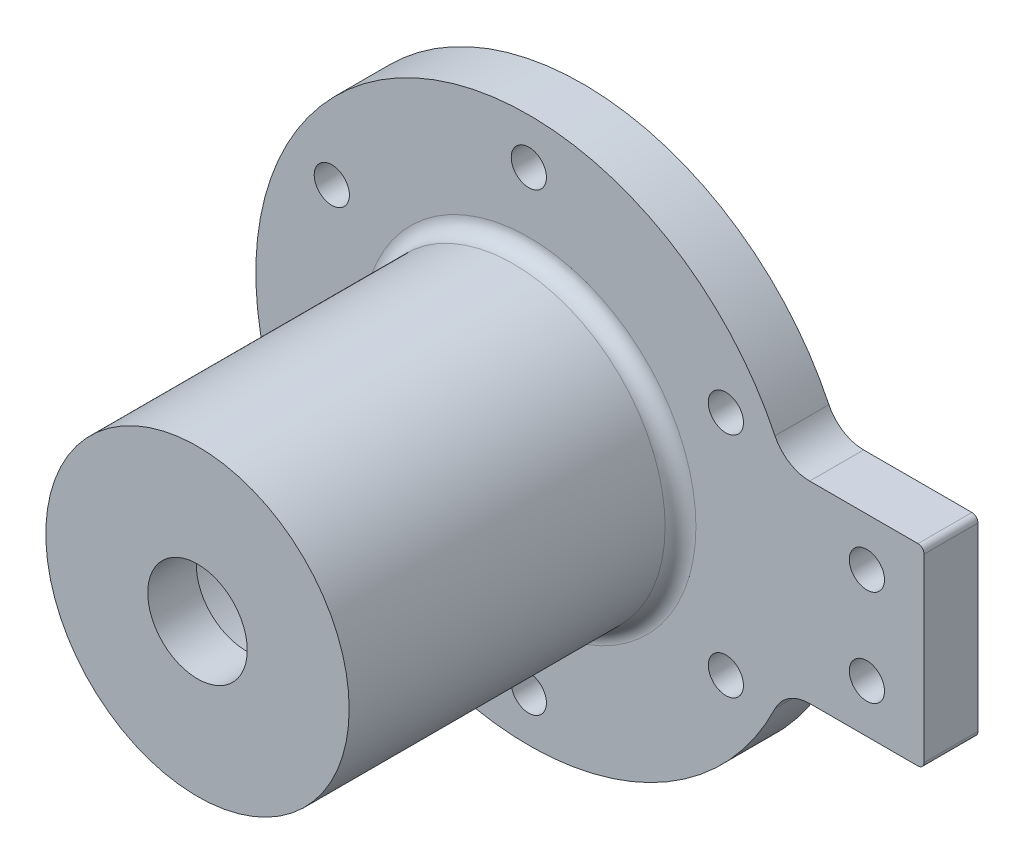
ISO-10303-21;
HEADER;
FILE_DESCRIPTION(('STEP AP214'),'2;1');
FILE_NAME('part.step','',(''),(''),'','','');
FILE_SCHEMA(('AUTOMOTIVE_DESIGN { 1 0 10303 214 1 1 1 1 }'));
ENDSEC;
DATA;
#1=APPLICATION_CONTEXT('core data for automotive mechanical design processes');
#2=APPLICATION_PROTOCOL_DEFINITION('international standard','automotive_design',2000,#1);
#3=PRODUCT_CONTEXT('',#1,'mechanical');
#4=PRODUCT('Part','Part','',(#3));
#5=PRODUCT_RELATED_PRODUCT_CATEGORY('part','',(#4));
#6=PRODUCT_DEFINITION_FORMATION('','',#4);
#7=PRODUCT_DEFINITION_CONTEXT('part definition',#1,'design');
#8=PRODUCT_DEFINITION('design','',#6,#7);
#9=PRODUCT_DEFINITION_SHAPE('','',#8);
#10=(LENGTH_UNIT() NAMED_UNIT(*) SI_UNIT(.MILLI.,.METRE.));
#11=(NAMED_UNIT(*) PLANE_ANGLE_UNIT() SI_UNIT($,.RADIAN.));
#12=(NAMED_UNIT(*) SI_UNIT($,.STERADIAN.) SOLID_ANGLE_UNIT());
#13=UNCERTAINTY_MEASURE_WITH_UNIT(LENGTH_MEASURE(1.E-05),#10,'distance_accuracy_value','');
#14=(GEOMETRIC_REPRESENTATION_CONTEXT(3) GLOBAL_UNCERTAINTY_ASSIGNED_CONTEXT((#13)) GLOBAL_UNIT_ASSIGNED_CONTEXT((#10,
#11,#12)) REPRESENTATION_CONTEXT('',''));
#15=CARTESIAN_POINT('',(0.,0.,0.));
#16=DIRECTION('',(0.,0.,1.));
#17=DIRECTION('',(1.,0.,0.));
#18=AXIS2_PLACEMENT_3D('',#15,#16,#17);
#19=CARTESIAN_POINT('',(0.,0.,0.));
#20=DIRECTION('',(0.,0.,1.));
#21=DIRECTION('',(1.,0.,0.));
#22=AXIS2_PLACEMENT_3D('',#19,#20,#21);
#23=PLANE('',#22);
#24=CARTESIAN_POINT('',(32.4759526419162,18.7500000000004,0.));
#25=DIRECTION('',(0.,0.,-1.));
#26=DIRECTION('',(-1.,0.,0.));
#27=AXIS2_PLACEMENT_3D('',#24,#25,#26);
#28=CIRCLE('',#27,2.89999999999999);
#29=CARTESIAN_POINT('',(29.5759526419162,18.7500000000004,0.));
#30=VERTEX_POINT('',#29);
#31=EDGE_CURVE('E158',#30,#30,#28,.T.);
#32=ORIENTED_EDGE('',*,*,#31,.F.);
#33=EDGE_LOOP('',(#32));
#34=FACE_BOUND('',#33,.T.);
#35=CARTESIAN_POINT('',(32.4759526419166,-18.7499999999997,0.));
#36=DIRECTION('',(0.,0.,-1.));
#37=DIRECTION('',(-1.,0.,0.));
#38=AXIS2_PLACEMENT_3D('',#35,#36,#37);
#39=CIRCLE('',#38,2.89999999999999);
#40=CARTESIAN_POINT('',(29.5759526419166,-18.7499999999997,0.));
#41=VERTEX_POINT('',#40);
#42=EDGE_CURVE('E182',#41,#41,#39,.T.);
#43=ORIENTED_EDGE('',*,*,#42,.F.);
#44=EDGE_LOOP('',(#43));
#45=FACE_BOUND('',#44,.T.);
#46=CARTESIAN_POINT('',(55.7158355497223,7.93750000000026,0.));
#47=DIRECTION('',(0.,0.,-1.));
#48=DIRECTION('',(-1.,0.,0.));
#49=AXIS2_PLACEMENT_3D('',#46,#47,#48);
#50=CIRCLE('',#49,2.89999999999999);
#51=CARTESIAN_POINT('',(52.8158355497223,7.93750000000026,0.));
#52=VERTEX_POINT('',#51);
#53=EDGE_CURVE('E186',#52,#52,#50,.T.);
#54=ORIENTED_EDGE('',*,*,#53,.F.);
#55=EDGE_LOOP('',(#54));
#56=FACE_BOUND('',#55,.T.);
#57=CARTESIAN_POINT('',(0.,0.,0.));
#58=DIRECTION('',(0.,0.,1.));
#59=DIRECTION('',(1.,0.,0.));
#60=AXIS2_PLACEMENT_3D('',#57,#58,#59);
#61=CIRCLE('',#60,20.);
#62=CARTESIAN_POINT('',(20.,0.,0.));
#63=VERTEX_POINT('',#62);
#64=EDGE_CURVE('E210',#63,#63,#61,.T.);
#65=ORIENTED_EDGE('',*,*,#64,.T.);
#66=EDGE_LOOP('',(#65));
#67=FACE_BOUND('',#66,.T.);
#68=DIRECTION('',(-1.,0.,0.));
#69=VECTOR('',#68,1.);
#70=CARTESIAN_POINT('',(0.,15.875,0.));
#71=LINE('',#70,#69);
#72=CARTESIAN_POINT('',(64.1405069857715,15.8749999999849,0.));
#73=VERTEX_POINT('',#72);
#74=CARTESIAN_POINT('',(46.2911641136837,15.875,0.));
#75=VERTEX_POINT('',#74);
#76=EDGE_CURVE('E200',#73,#75,#71,.T.);
#77=ORIENTED_EDGE('',*,*,#76,.F.);
#78=CARTESIAN_POINT('',(64.1405069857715,14.874999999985,0.));
#79=DIRECTION('',(0.,0.,1.));
#80=DIRECTION('',(1.,0.,0.));
#81=AXIS2_PLACEMENT_3D('',#78,#79,#80);
#82=CIRCLE('',#81,0.999999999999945);
#83=CARTESIAN_POINT('',(65.1405069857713,14.874999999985,0.));
#84=VERTEX_POINT('',#83);
#85=EDGE_CURVE('E129',#84,#73,#82,.T.);
#86=ORIENTED_EDGE('',*,*,#85,.F.);
#87=DIRECTION('',(0.,1.,0.));
#88=VECTOR('',#87,1.);
#89=CARTESIAN_POINT('',(65.1405069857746,-2.20433296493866E-12,0.));
#90=LINE('',#89,#88);
#91=CARTESIAN_POINT('',(65.1405069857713,-14.8750000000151,0.));
#92=VERTEX_POINT('',#91);
#93=EDGE_CURVE('E194',#92,#84,#90,.T.);
#94=ORIENTED_EDGE('',*,*,#93,.F.);
#95=CARTESIAN_POINT('',(64.1405069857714,-14.8750000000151,0.));
#96=DIRECTION('',(0.,0.,1.));
#97=DIRECTION('',(1.,0.,0.));
#98=AXIS2_PLACEMENT_3D('',#95,#96,#97);
#99=CIRCLE('',#98,0.999999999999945);
#100=CARTESIAN_POINT('',(64.1405069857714,-15.875000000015,0.));
#101=VERTEX_POINT('',#100);
#102=EDGE_CURVE('E140',#101,#92,#99,.T.);
#103=ORIENTED_EDGE('',*,*,#102,.F.);
#104=DIRECTION('',(-1.,0.,0.));
#105=VECTOR('',#104,1.);
#106=CARTESIAN_POINT('',(0.,-15.875,0.));
#107=LINE('',#106,#105);
#108=CARTESIAN_POINT('',(46.2911641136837,-15.875,0.));
#109=VERTEX_POINT('',#108);
#110=EDGE_CURVE('E121',#101,#109,#107,.T.);
#111=ORIENTED_EDGE('',*,*,#110,.T.);
#112=CARTESIAN_POINT('',(46.2911641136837,-22.225,0.));
#113=DIRECTION('',(0.,0.,1.));
#114=DIRECTION('',(1.,0.,0.));
#115=AXIS2_PLACEMENT_3D('',#112,#113,#114);
#116=CIRCLE('',#115,6.35);
#117=CARTESIAN_POINT('',(40.5667455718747,-19.4766309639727,0.));
#118=VERTEX_POINT('',#117);
#119=EDGE_CURVE('E66',#109,#118,#116,.T.);
#120=ORIENTED_EDGE('',*,*,#119,.T.);
#121=CARTESIAN_POINT('',(0.,0.,0.));
#122=DIRECTION('',(0.,0.,1.));
#123=DIRECTION('',(1.,0.,0.));
#124=AXIS2_PLACEMENT_3D('',#121,#122,#123);
#125=CIRCLE('',#124,45.);
#126=CARTESIAN_POINT('',(40.5667455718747,19.4766309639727,0.));
#127=VERTEX_POINT('',#126);
#128=EDGE_CURVE('E120',#127,#118,#125,.T.);
#129=ORIENTED_EDGE('',*,*,#128,.F.);
#130=CARTESIAN_POINT('',(46.2911641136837,22.225,0.));
#131=DIRECTION('',(0.,0.,1.));
#132=DIRECTION('',(1.,0.,0.));
#133=AXIS2_PLACEMENT_3D('',#130,#131,#132);
#134=CIRCLE('',#133,6.35);
#135=EDGE_CURVE('E224',#127,#75,#134,.T.);
#136=ORIENTED_EDGE('',*,*,#135,.T.);
#137=EDGE_LOOP('',(#77,#86,#94,#103,#111,#120,#129,#136));
#138=FACE_BOUND('',#137,.T.);
#139=CARTESIAN_POINT('',(55.7158355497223,-7.93749999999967,0.));
#140=DIRECTION('',(0.,0.,-1.));
#141=DIRECTION('',(-1.,0.,0.));
#142=AXIS2_PLACEMENT_3D('',#139,#140,#141);
#143=CIRCLE('',#142,2.89999999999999);
#144=CARTESIAN_POINT('',(52.8158355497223,-7.93749999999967,0.));
#145=VERTEX_POINT('',#144);
#146=EDGE_CURVE('E190',#145,#145,#143,.T.);
#147=ORIENTED_EDGE('',*,*,#146,.F.);
#148=EDGE_LOOP('',(#147));
#149=FACE_BOUND('',#148,.T.);
#150=CARTESIAN_POINT('',(0.,-37.5,0.));
#151=DIRECTION('',(0.,0.,-1.));
#152=DIRECTION('',(-1.,0.,0.));
#153=AXIS2_PLACEMENT_3D('',#150,#151,#152);
#154=CIRCLE('',#153,2.89999999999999);
#155=CARTESIAN_POINT('',(-2.89999999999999,-37.5,0.));
#156=VERTEX_POINT('',#155);
#157=EDGE_CURVE('E178',#156,#156,#154,.T.);
#158=ORIENTED_EDGE('',*,*,#157,.F.);
#159=EDGE_LOOP('',(#158));
#160=FACE_BOUND('',#159,.T.);
#161=CARTESIAN_POINT('',(-32.4759526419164,-18.7500000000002,0.));
#162=DIRECTION('',(0.,0.,-1.));
#163=DIRECTION('',(-1.,0.,0.));
#164=AXIS2_PLACEMENT_3D('',#161,#162,#163);
#165=CIRCLE('',#164,2.89999999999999);
#166=CARTESIAN_POINT('',(-35.3759526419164,-18.7500000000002,0.));
#167=VERTEX_POINT('',#166);
#168=EDGE_CURVE('E172',#167,#167,#165,.T.);
#169=ORIENTED_EDGE('',*,*,#168,.F.);
#170=EDGE_LOOP('',(#169));
#171=FACE_BOUND('',#170,.T.);
#172=CARTESIAN_POINT('',(-32.4759526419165,18.7499999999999,0.));
#173=DIRECTION('',(0.,0.,-1.));
#174=DIRECTION('',(-1.,0.,0.));
#175=AXIS2_PLACEMENT_3D('',#172,#173,#174);
#176=CIRCLE('',#175,2.89999999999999);
#177=CARTESIAN_POINT('',(-35.3759526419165,18.7499999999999,0.));
#178=VERTEX_POINT('',#177);
#179=EDGE_CURVE('E166',#178,#178,#176,.T.);
#180=ORIENTED_EDGE('',*,*,#179,.F.);
#181=EDGE_LOOP('',(#180));
#182=FACE_BOUND('',#181,.T.);
#183=CARTESIAN_POINT('',(0.,37.5,0.));
#184=DIRECTION('',(0.,0.,-1.));
#185=DIRECTION('',(-1.,0.,0.));
#186=AXIS2_PLACEMENT_3D('',#183,#184,#185);
#187=CIRCLE('',#186,2.89999999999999);
#188=CARTESIAN_POINT('',(-2.89999999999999,37.5,0.));
#189=VERTEX_POINT('',#188);
#190=EDGE_CURVE('E162',#189,#189,#187,.T.);
#191=ORIENTED_EDGE('',*,*,#190,.F.);
#192=EDGE_LOOP('',(#191));
#193=FACE_BOUND('',#192,.T.);
#194=ADVANCED_FACE('F43',(#34,#45,#56,#67,#138,#149,#160,#171,#182,#193),#23,.F.);
#195=CARTESIAN_POINT('',(0.,0.,63.5));
#196=DIRECTION('',(0.,0.,-1.));
#197=DIRECTION('',(-1.,0.,0.));
#198=AXIS2_PLACEMENT_3D('',#195,#196,#197);
#199=CYLINDRICAL_SURFACE('',#198,20.);
#200=ORIENTED_EDGE('',*,*,#64,.F.);
#201=EDGE_LOOP('',(#200));
#202=FACE_BOUND('',#201,.T.);
#203=CARTESIAN_POINT('',(0.,0.,55.5));
#204=DIRECTION('',(0.,0.,1.));
#205=DIRECTION('',(1.,0.,0.));
#206=AXIS2_PLACEMENT_3D('',#203,#204,#205);
#207=CIRCLE('',#206,20.);
#208=CARTESIAN_POINT('',(20.,0.,55.5));
#209=VERTEX_POINT('',#208);
#210=EDGE_CURVE('E205',#209,#209,#207,.T.);
#211=ORIENTED_EDGE('',*,*,#210,.T.);
#212=EDGE_LOOP('',(#211));
#213=FACE_BOUND('',#212,.T.);
#214=ADVANCED_FACE('F265',(#202,#213),#199,.F.);
#215=CARTESIAN_POINT('',(0.,0.,63.5));
#216=DIRECTION('',(0.,0.,1.));
#217=DIRECTION('',(1.,0.,0.));
#218=AXIS2_PLACEMENT_3D('',#215,#216,#217);
#219=PLANE('',#218);
#220=CARTESIAN_POINT('',(0.,0.,63.5));
#221=DIRECTION('',(0.,0.,1.));
#222=DIRECTION('',(1.,0.,0.));
#223=AXIS2_PLACEMENT_3D('',#220,#221,#222);
#224=CIRCLE('',#223,8.2);
#225=CARTESIAN_POINT('',(8.2,0.,63.5));
#226=VERTEX_POINT('',#225);
#227=EDGE_CURVE('E143',#226,#226,#224,.T.);
#228=ORIENTED_EDGE('',*,*,#227,.F.);
#229=EDGE_LOOP('',(#228));
#230=FACE_BOUND('',#229,.T.);
#231=CARTESIAN_POINT('',(0.,0.,63.5));
#232=DIRECTION('',(0.,0.,1.));
#233=DIRECTION('',(1.,0.,0.));
#234=AXIS2_PLACEMENT_3D('',#231,#232,#233);
#235=CIRCLE('',#234,25.);
#236=CARTESIAN_POINT('',(25.,0.,63.5));
#237=VERTEX_POINT('',#236);
#238=EDGE_CURVE('E213',#237,#237,#235,.T.);
#239=ORIENTED_EDGE('',*,*,#238,.T.);
#240=EDGE_LOOP('',(#239));
#241=FACE_BOUND('',#240,.T.);
#242=ADVANCED_FACE('F272',(#230,#241),#219,.T.);
#243=CARTESIAN_POINT('',(0.,0.,63.5));
#244=DIRECTION('',(0.,0.,-1.));
#245=DIRECTION('',(-1.,0.,0.));
#246=AXIS2_PLACEMENT_3D('',#243,#244,#245);
#247=CYLINDRICAL_SURFACE('',#246,25.);
#248=CARTESIAN_POINT('',(0.,0.,11.43));
#249=DIRECTION('',(0.,0.,1.));
#250=DIRECTION('',(1.,0.,0.));
#251=AXIS2_PLACEMENT_3D('',#248,#249,#250);
#252=CIRCLE('',#251,25.);
#253=CARTESIAN_POINT('',(25.,0.,11.43));
#254=VERTEX_POINT('',#253);
#255=EDGE_CURVE('E51',#254,#254,#252,.T.);
#256=ORIENTED_EDGE('',*,*,#255,.T.);
#257=EDGE_LOOP('',(#256));
#258=FACE_BOUND('',#257,.T.);
#259=ORIENTED_EDGE('',*,*,#238,.F.);
#260=EDGE_LOOP('',(#259));
#261=FACE_BOUND('',#260,.T.);
#262=ADVANCED_FACE('F244',(#258,#261),#247,.T.);
#263=CARTESIAN_POINT('',(0.,0.,55.5));
#264=DIRECTION('',(0.,0.,1.));
#265=DIRECTION('',(1.,0.,0.));
#266=AXIS2_PLACEMENT_3D('',#263,#264,#265);
#267=PLANE('',#266);
#268=CARTESIAN_POINT('',(0.,0.,55.5));
#269=DIRECTION('',(0.,0.,1.));
#270=DIRECTION('',(1.,0.,0.));
#271=AXIS2_PLACEMENT_3D('',#268,#269,#270);
#272=CIRCLE('',#271,8.2);
#273=CARTESIAN_POINT('',(8.2,0.,55.5));
#274=VERTEX_POINT('',#273);
#275=EDGE_CURVE('E155',#274,#274,#272,.F.);
#276=ORIENTED_EDGE('',*,*,#275,.F.);
#277=EDGE_LOOP('',(#276));
#278=FACE_BOUND('',#277,.T.);
#279=ORIENTED_EDGE('',*,*,#210,.F.);
#280=EDGE_LOOP('',(#279));
#281=FACE_BOUND('',#280,.T.);
#282=ADVANCED_FACE('F280',(#278,#281),#267,.F.);
#283=CARTESIAN_POINT('',(0.,0.,8.89));
#284=DIRECTION('',(0.,0.,1.));
#285=DIRECTION('',(1.,0.,0.));
#286=AXIS2_PLACEMENT_3D('',#283,#284,#285);
#287=PLANE('',#286);
#288=CARTESIAN_POINT('',(0.,0.,8.89));
#289=DIRECTION('',(0.,0.,1.));
#290=DIRECTION('',(1.,0.,0.));
#291=AXIS2_PLACEMENT_3D('',#288,#289,#290);
#292=CIRCLE('',#291,27.54);
#293=CARTESIAN_POINT('',(27.54,0.,8.89));
#294=VERTEX_POINT('',#293);
#295=EDGE_CURVE('E11',#294,#294,#292,.F.);
#296=ORIENTED_EDGE('',*,*,#295,.T.);
#297=EDGE_LOOP('',(#296));
#298=FACE_BOUND('',#297,.T.);
#299=CARTESIAN_POINT('',(32.4759526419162,18.7500000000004,8.89));
#300=DIRECTION('',(0.,0.,1.));
#301=DIRECTION('',(1.,0.,0.));
#302=AXIS2_PLACEMENT_3D('',#299,#300,#301);
#303=CIRCLE('',#302,2.89999999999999);
#304=CARTESIAN_POINT('',(35.3759526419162,18.7500000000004,8.89));
#305=VERTEX_POINT('',#304);
#306=EDGE_CURVE('E161',#305,#305,#303,.T.);
#307=ORIENTED_EDGE('',*,*,#306,.F.);
#308=EDGE_LOOP('',(#307));
#309=FACE_BOUND('',#308,.T.);
#310=CARTESIAN_POINT('',(0.,37.5,8.89));
#311=DIRECTION('',(0.,0.,1.));
#312=DIRECTION('',(1.,0.,0.));
#313=AXIS2_PLACEMENT_3D('',#310,#311,#312);
#314=CIRCLE('',#313,2.89999999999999);
#315=CARTESIAN_POINT('',(2.89999999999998,37.5,8.89));
#316=VERTEX_POINT('',#315);
#317=EDGE_CURVE('E165',#316,#316,#314,.T.);
#318=ORIENTED_EDGE('',*,*,#317,.F.);
#319=EDGE_LOOP('',(#318));
#320=FACE_BOUND('',#319,.T.);
#321=CARTESIAN_POINT('',(-32.4759526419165,18.7499999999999,8.89));
#322=DIRECTION('',(0.,0.,1.));
#323=DIRECTION('',(1.,0.,0.));
#324=AXIS2_PLACEMENT_3D('',#321,#322,#323);
#325=CIRCLE('',#324,2.89999999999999);
#326=CARTESIAN_POINT('',(-29.5759526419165,18.7499999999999,8.89));
#327=VERTEX_POINT('',#326);
#328=EDGE_CURVE('E169',#327,#327,#325,.T.);
#329=ORIENTED_EDGE('',*,*,#328,.F.);
#330=EDGE_LOOP('',(#329));
#331=FACE_BOUND('',#330,.T.);
#332=CARTESIAN_POINT('',(-32.4759526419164,-18.7500000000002,8.89));
#333=DIRECTION('',(0.,0.,1.));
#334=DIRECTION('',(1.,0.,0.));
#335=AXIS2_PLACEMENT_3D('',#332,#333,#334);
#336=CIRCLE('',#335,2.89999999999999);
#337=CARTESIAN_POINT('',(-29.5759526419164,-18.7500000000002,8.89));
#338=VERTEX_POINT('',#337);
#339=EDGE_CURVE('E175',#338,#338,#336,.T.);
#340=ORIENTED_EDGE('',*,*,#339,.F.);
#341=EDGE_LOOP('',(#340));
#342=FACE_BOUND('',#341,.T.);
#343=CARTESIAN_POINT('',(0.,-37.5,8.89));
#344=DIRECTION('',(0.,0.,1.));
#345=DIRECTION('',(1.,0.,0.));
#346=AXIS2_PLACEMENT_3D('',#343,#344,#345);
#347=CIRCLE('',#346,2.89999999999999);
#348=CARTESIAN_POINT('',(2.89999999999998,-37.5,8.89));
#349=VERTEX_POINT('',#348);
#350=EDGE_CURVE('E181',#349,#349,#347,.T.);
#351=ORIENTED_EDGE('',*,*,#350,.F.);
#352=EDGE_LOOP('',(#351));
#353=FACE_BOUND('',#352,.T.);
#354=CARTESIAN_POINT('',(32.4759526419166,-18.7499999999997,8.89));
#355=DIRECTION('',(0.,0.,1.));
#356=DIRECTION('',(1.,0.,0.));
#357=AXIS2_PLACEMENT_3D('',#354,#355,#356);
#358=CIRCLE('',#357,2.89999999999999);
#359=CARTESIAN_POINT('',(35.3759526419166,-18.7499999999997,8.89));
#360=VERTEX_POINT('',#359);
#361=EDGE_CURVE('E185',#360,#360,#358,.T.);
#362=ORIENTED_EDGE('',*,*,#361,.F.);
#363=EDGE_LOOP('',(#362));
#364=FACE_BOUND('',#363,.T.);
#365=CARTESIAN_POINT('',(55.7158355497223,7.93750000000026,8.89));
#366=DIRECTION('',(0.,0.,1.));
#367=DIRECTION('',(1.,0.,0.));
#368=AXIS2_PLACEMENT_3D('',#365,#366,#367);
#369=CIRCLE('',#368,2.89999999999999);
#370=CARTESIAN_POINT('',(58.6158355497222,7.93750000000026,8.89));
#371=VERTEX_POINT('',#370);
#372=EDGE_CURVE('E189',#371,#371,#369,.T.);
#373=ORIENTED_EDGE('',*,*,#372,.F.);
#374=EDGE_LOOP('',(#373));
#375=FACE_BOUND('',#374,.T.);
#376=CARTESIAN_POINT('',(55.7158355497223,-7.93749999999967,8.89));
#377=DIRECTION('',(0.,0.,1.));
#378=DIRECTION('',(1.,0.,0.));
#379=AXIS2_PLACEMENT_3D('',#376,#377,#378);
#380=CIRCLE('',#379,2.89999999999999);
#381=CARTESIAN_POINT('',(58.6158355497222,-7.93749999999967,8.89));
#382=VERTEX_POINT('',#381);
#383=EDGE_CURVE('E193',#382,#382,#380,.T.);
#384=ORIENTED_EDGE('',*,*,#383,.F.);
#385=EDGE_LOOP('',(#384));
#386=FACE_BOUND('',#385,.T.);
#387=DIRECTION('',(0.,-1.,0.));
#388=VECTOR('',#387,1.);
#389=CARTESIAN_POINT('',(65.1405069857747,-2.20433296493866E-12,8.89000000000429));
#390=LINE('',#389,#388);
#391=CARTESIAN_POINT('',(65.1405069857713,14.874999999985,8.88999999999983));
#392=VERTEX_POINT('',#391);
#393=CARTESIAN_POINT('',(65.1405069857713,-14.8750000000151,8.88999999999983));
#394=VERTEX_POINT('',#393);
#395=EDGE_CURVE('E134',#392,#394,#390,.T.);
#396=ORIENTED_EDGE('',*,*,#395,.F.);
#397=CARTESIAN_POINT('',(64.1405069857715,14.874999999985,8.88999999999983));
#398=DIRECTION('',(0.,0.,-1.));
#399=DIRECTION('',(-1.,0.,0.));
#400=AXIS2_PLACEMENT_3D('',#397,#398,#399);
#401=CIRCLE('',#400,0.999999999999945);
#402=CARTESIAN_POINT('',(64.1405069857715,15.874999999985,8.88999999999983));
#403=VERTEX_POINT('',#402);
#404=EDGE_CURVE('E127',#403,#392,#401,.T.);
#405=ORIENTED_EDGE('',*,*,#404,.F.);
#406=DIRECTION('',(-1.,0.,0.));
#407=VECTOR('',#406,1.);
#408=CARTESIAN_POINT('',(0.,15.875,8.89));
#409=LINE('',#408,#407);
#410=CARTESIAN_POINT('',(46.2911641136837,15.875,8.89));
#411=VERTEX_POINT('',#410);
#412=EDGE_CURVE('E110',#403,#411,#409,.T.);
#413=ORIENTED_EDGE('',*,*,#412,.T.);
#414=CARTESIAN_POINT('',(46.2911641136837,22.225,8.89));
#415=DIRECTION('',(0.,0.,1.));
#416=DIRECTION('',(1.,0.,0.));
#417=AXIS2_PLACEMENT_3D('',#414,#415,#416);
#418=CIRCLE('',#417,6.35);
#419=CARTESIAN_POINT('',(40.5667455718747,19.4766309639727,8.89));
#420=VERTEX_POINT('',#419);
#421=EDGE_CURVE('E226',#411,#420,#418,.F.);
#422=ORIENTED_EDGE('',*,*,#421,.T.);
#423=CARTESIAN_POINT('',(0.,0.,8.89));
#424=DIRECTION('',(0.,0.,1.));
#425=DIRECTION('',(1.,0.,0.));
#426=AXIS2_PLACEMENT_3D('',#423,#424,#425);
#427=CIRCLE('',#426,45.);
#428=CARTESIAN_POINT('',(40.5667455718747,-19.4766309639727,8.89));
#429=VERTEX_POINT('',#428);
#430=EDGE_CURVE('E203',#420,#429,#427,.T.);
#431=ORIENTED_EDGE('',*,*,#430,.T.);
#432=CARTESIAN_POINT('',(46.2911641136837,-22.225,8.89));
#433=DIRECTION('',(0.,0.,1.));
#434=DIRECTION('',(1.,0.,0.));
#435=AXIS2_PLACEMENT_3D('',#432,#433,#434);
#436=CIRCLE('',#435,6.35);
#437=CARTESIAN_POINT('',(46.2911641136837,-15.875,8.89));
#438=VERTEX_POINT('',#437);
#439=EDGE_CURVE('E58',#429,#438,#436,.F.);
#440=ORIENTED_EDGE('',*,*,#439,.T.);
#441=DIRECTION('',(-1.,0.,0.));
#442=VECTOR('',#441,1.);
#443=CARTESIAN_POINT('',(0.,-15.875,8.89));
#444=LINE('',#443,#442);
#445=CARTESIAN_POINT('',(64.1405069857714,-15.875000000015,8.88999999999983));
#446=VERTEX_POINT('',#445);
#447=EDGE_CURVE('E196',#446,#438,#444,.T.);
#448=ORIENTED_EDGE('',*,*,#447,.F.);
#449=CARTESIAN_POINT('',(64.1405069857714,-14.8750000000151,8.88999999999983));
#450=DIRECTION('',(0.,0.,-1.));
#451=DIRECTION('',(-1.,0.,0.));
#452=AXIS2_PLACEMENT_3D('',#449,#450,#451);
#453=CIRCLE('',#452,0.999999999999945);
#454=EDGE_CURVE('E145',#394,#446,#453,.T.);
#455=ORIENTED_EDGE('',*,*,#454,.F.);
#456=EDGE_LOOP('',(#396,#405,#413,#422,#431,#440,#448,#455));
#457=FACE_BOUND('',#456,.T.);
#458=ADVANCED_FACE('F132',(#298,#309,#320,#331,#342,#353,#364,#375,#386,#457),#287,.T.);
#459=CARTESIAN_POINT('',(0.,0.,8.89));
#460=DIRECTION('',(0.,0.,-1.));
#461=DIRECTION('',(-1.,0.,0.));
#462=AXIS2_PLACEMENT_3D('',#459,#460,#461);
#463=CYLINDRICAL_SURFACE('',#462,45.);
#464=ORIENTED_EDGE('',*,*,#430,.F.);
#465=DIRECTION('',(0.,0.,-1.));
#466=VECTOR('',#465,1.);
#467=CARTESIAN_POINT('',(40.5667455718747,19.4766309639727,8.89));
#468=LINE('',#467,#466);
#469=EDGE_CURVE('E218',#420,#127,#468,.T.);
#470=ORIENTED_EDGE('',*,*,#469,.T.);
#471=ORIENTED_EDGE('',*,*,#128,.T.);
#472=DIRECTION('',(0.,0.,-1.));
#473=VECTOR('',#472,1.);
#474=CARTESIAN_POINT('',(40.5667455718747,-19.4766309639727,8.89));
#475=LINE('',#474,#473);
#476=EDGE_CURVE('E216',#118,#429,#475,.F.);
#477=ORIENTED_EDGE('',*,*,#476,.T.);
#478=EDGE_LOOP('',(#464,#470,#471,#477));
#479=FACE_BOUND('',#478,.T.);
#480=ADVANCED_FACE('F306',(#479),#463,.T.);
#481=CARTESIAN_POINT('',(0.,-15.875,46.0994860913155));
#482=DIRECTION('',(0.,-1.,0.));
#483=DIRECTION('',(0.,0.,-1.));
#484=AXIS2_PLACEMENT_3D('',#481,#482,#483);
#485=PLANE('',#484);
#486=ORIENTED_EDGE('',*,*,#110,.F.);
#487=DIRECTION('',(0.,0.,1.));
#488=VECTOR('',#487,1.);
#489=CARTESIAN_POINT('',(64.1405069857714,-15.875000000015,-3.59210244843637));
#490=LINE('',#489,#488);
#491=EDGE_CURVE('E148',#101,#446,#490,.T.);
#492=ORIENTED_EDGE('',*,*,#491,.T.);
#493=ORIENTED_EDGE('',*,*,#447,.T.);
#494=DIRECTION('',(0.,0.,-1.));
#495=VECTOR('',#494,1.);
#496=CARTESIAN_POINT('',(46.2911641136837,-15.875,46.0994860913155));
#497=LINE('',#496,#495);
#498=EDGE_CURVE('E222',#438,#109,#497,.T.);
#499=ORIENTED_EDGE('',*,*,#498,.T.);
#500=EDGE_LOOP('',(#486,#492,#493,#499));
#501=FACE_BOUND('',#500,.T.);
#502=ADVANCED_FACE('F295',(#501),#485,.T.);
#503=CARTESIAN_POINT('',(0.,15.875,46.0994860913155));
#504=DIRECTION('',(0.,-1.,0.));
#505=DIRECTION('',(0.,0.,-1.));
#506=AXIS2_PLACEMENT_3D('',#503,#504,#505);
#507=PLANE('',#506);
#508=ORIENTED_EDGE('',*,*,#76,.T.);
#509=DIRECTION('',(0.,0.,1.));
#510=VECTOR('',#509,1.);
#511=CARTESIAN_POINT('',(46.2911641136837,15.875,8.89));
#512=LINE('',#511,#510);
#513=EDGE_CURVE('E117',#75,#411,#512,.T.);
#514=ORIENTED_EDGE('',*,*,#513,.T.);
#515=ORIENTED_EDGE('',*,*,#412,.F.);
#516=DIRECTION('',(0.,0.,1.));
#517=VECTOR('',#516,1.);
#518=CARTESIAN_POINT('',(64.1405069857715,15.874999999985,-3.59210244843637));
#519=LINE('',#518,#517);
#520=EDGE_CURVE('E114',#73,#403,#519,.T.);
#521=ORIENTED_EDGE('',*,*,#520,.F.);
#522=EDGE_LOOP('',(#508,#514,#515,#521));
#523=FACE_BOUND('',#522,.T.);
#524=ADVANCED_FACE('F113',(#523),#507,.F.);
#525=CARTESIAN_POINT('',(46.2911641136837,22.225,8.89));
#526=DIRECTION('',(0.,0.,-1.));
#527=DIRECTION('',(-1.,0.,0.));
#528=AXIS2_PLACEMENT_3D('',#525,#526,#527);
#529=CYLINDRICAL_SURFACE('',#528,6.35);
#530=ORIENTED_EDGE('',*,*,#421,.F.);
#531=ORIENTED_EDGE('',*,*,#513,.F.);
#532=ORIENTED_EDGE('',*,*,#135,.F.);
#533=ORIENTED_EDGE('',*,*,#469,.F.);
#534=EDGE_LOOP('',(#530,#531,#532,#533));
#535=FACE_BOUND('',#534,.T.);
#536=ADVANCED_FACE('F281',(#535),#529,.F.);
#537=CARTESIAN_POINT('',(46.2911641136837,-22.225,8.89));
#538=DIRECTION('',(0.,0.,-1.));
#539=DIRECTION('',(-1.,0.,0.));
#540=AXIS2_PLACEMENT_3D('',#537,#538,#539);
#541=CYLINDRICAL_SURFACE('',#540,6.35);
#542=ORIENTED_EDGE('',*,*,#439,.F.);
#543=ORIENTED_EDGE('',*,*,#476,.F.);
#544=ORIENTED_EDGE('',*,*,#119,.F.);
#545=ORIENTED_EDGE('',*,*,#498,.F.);
#546=EDGE_LOOP('',(#542,#543,#544,#545));
#547=FACE_BOUND('',#546,.T.);
#548=ADVANCED_FACE('F283',(#547),#541,.F.);
#549=CARTESIAN_POINT('',(65.1405069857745,-2.20433296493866E-12,-33.2817220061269));
#550=DIRECTION('',(-1.,0.,0.));
#551=DIRECTION('',(0.,-1.,0.));
#552=AXIS2_PLACEMENT_3D('',#549,#550,#551);
#553=PLANE('',#552);
#554=ORIENTED_EDGE('',*,*,#395,.T.);
#555=DIRECTION('',(0.,0.,1.));
#556=VECTOR('',#555,1.);
#557=CARTESIAN_POINT('',(65.1405069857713,-14.8750000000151,-3.59210244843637));
#558=LINE('',#557,#556);
#559=EDGE_CURVE('E144',#92,#394,#558,.T.);
#560=ORIENTED_EDGE('',*,*,#559,.F.);
#561=ORIENTED_EDGE('',*,*,#93,.T.);
#562=DIRECTION('',(0.,0.,1.));
#563=VECTOR('',#562,1.);
#564=CARTESIAN_POINT('',(65.1405069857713,14.874999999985,-3.59210244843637));
#565=LINE('',#564,#563);
#566=EDGE_CURVE('E130',#84,#392,#565,.T.);
#567=ORIENTED_EDGE('',*,*,#566,.T.);
#568=EDGE_LOOP('',(#554,#560,#561,#567));
#569=FACE_BOUND('',#568,.T.);
#570=ADVANCED_FACE('F286',(#569),#553,.F.);
#571=CARTESIAN_POINT('',(55.7158355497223,-7.93749999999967,0.));
#572=DIRECTION('',(0.,0.,-1.));
#573=DIRECTION('',(-1.,0.,0.));
#574=AXIS2_PLACEMENT_3D('',#571,#572,#573);
#575=CYLINDRICAL_SURFACE('',#574,2.89999999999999);
#576=ORIENTED_EDGE('',*,*,#383,.T.);
#577=EDGE_LOOP('',(#576));
#578=FACE_BOUND('',#577,.T.);
#579=ORIENTED_EDGE('',*,*,#146,.T.);
#580=EDGE_LOOP('',(#579));
#581=FACE_BOUND('',#580,.T.);
#582=ADVANCED_FACE('F291',(#578,#581),#575,.F.);
#583=CARTESIAN_POINT('',(55.7158355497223,7.93750000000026,0.));
#584=DIRECTION('',(0.,0.,-1.));
#585=DIRECTION('',(-1.,0.,0.));
#586=AXIS2_PLACEMENT_3D('',#583,#584,#585);
#587=CYLINDRICAL_SURFACE('',#586,2.89999999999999);
#588=ORIENTED_EDGE('',*,*,#372,.T.);
#589=EDGE_LOOP('',(#588));
#590=FACE_BOUND('',#589,.T.);
#591=ORIENTED_EDGE('',*,*,#53,.T.);
#592=EDGE_LOOP('',(#591));
#593=FACE_BOUND('',#592,.T.);
#594=ADVANCED_FACE('F445',(#590,#593),#587,.F.);
#595=CARTESIAN_POINT('',(32.4759526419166,-18.7499999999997,0.));
#596=DIRECTION('',(0.,0.,-1.));
#597=DIRECTION('',(-1.,0.,0.));
#598=AXIS2_PLACEMENT_3D('',#595,#596,#597);
#599=CYLINDRICAL_SURFACE('',#598,2.89999999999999);
#600=ORIENTED_EDGE('',*,*,#361,.T.);
#601=EDGE_LOOP('',(#600));
#602=FACE_BOUND('',#601,.T.);
#603=ORIENTED_EDGE('',*,*,#42,.T.);
#604=EDGE_LOOP('',(#603));
#605=FACE_BOUND('',#604,.T.);
#606=ADVANCED_FACE('F441',(#602,#605),#599,.F.);
#607=CARTESIAN_POINT('',(0.,-37.5,0.));
#608=DIRECTION('',(0.,0.,-1.));
#609=DIRECTION('',(-1.,0.,0.));
#610=AXIS2_PLACEMENT_3D('',#607,#608,#609);
#611=CYLINDRICAL_SURFACE('',#610,2.89999999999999);
#612=ORIENTED_EDGE('',*,*,#350,.T.);
#613=EDGE_LOOP('',(#612));
#614=FACE_BOUND('',#613,.T.);
#615=ORIENTED_EDGE('',*,*,#157,.T.);
#616=EDGE_LOOP('',(#615));
#617=FACE_BOUND('',#616,.T.);
#618=ADVANCED_FACE('F437',(#614,#617),#611,.F.);
#619=CARTESIAN_POINT('',(-32.4759526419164,-18.7500000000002,0.));
#620=DIRECTION('',(0.,0.,-1.));
#621=DIRECTION('',(-1.,0.,0.));
#622=AXIS2_PLACEMENT_3D('',#619,#620,#621);
#623=CYLINDRICAL_SURFACE('',#622,2.89999999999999);
#624=ORIENTED_EDGE('',*,*,#339,.T.);
#625=EDGE_LOOP('',(#624));
#626=FACE_BOUND('',#625,.T.);
#627=ORIENTED_EDGE('',*,*,#168,.T.);
#628=EDGE_LOOP('',(#627));
#629=FACE_BOUND('',#628,.T.);
#630=ADVANCED_FACE('F433',(#626,#629),#623,.F.);
#631=CARTESIAN_POINT('',(-32.4759526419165,18.7499999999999,0.));
#632=DIRECTION('',(0.,0.,-1.));
#633=DIRECTION('',(-1.,0.,0.));
#634=AXIS2_PLACEMENT_3D('',#631,#632,#633);
#635=CYLINDRICAL_SURFACE('',#634,2.89999999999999);
#636=ORIENTED_EDGE('',*,*,#328,.T.);
#637=EDGE_LOOP('',(#636));
#638=FACE_BOUND('',#637,.T.);
#639=ORIENTED_EDGE('',*,*,#179,.T.);
#640=EDGE_LOOP('',(#639));
#641=FACE_BOUND('',#640,.T.);
#642=ADVANCED_FACE('F429',(#638,#641),#635,.F.);
#643=CARTESIAN_POINT('',(0.,37.5,0.));
#644=DIRECTION('',(0.,0.,-1.));
#645=DIRECTION('',(-1.,0.,0.));
#646=AXIS2_PLACEMENT_3D('',#643,#644,#645);
#647=CYLINDRICAL_SURFACE('',#646,2.89999999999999);
#648=ORIENTED_EDGE('',*,*,#317,.T.);
#649=EDGE_LOOP('',(#648));
#650=FACE_BOUND('',#649,.T.);
#651=ORIENTED_EDGE('',*,*,#190,.T.);
#652=EDGE_LOOP('',(#651));
#653=FACE_BOUND('',#652,.T.);
#654=ADVANCED_FACE('F260',(#650,#653),#647,.F.);
#655=CARTESIAN_POINT('',(32.4759526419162,18.7500000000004,0.));
#656=DIRECTION('',(0.,0.,-1.));
#657=DIRECTION('',(-1.,0.,0.));
#658=AXIS2_PLACEMENT_3D('',#655,#656,#657);
#659=CYLINDRICAL_SURFACE('',#658,2.89999999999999);
#660=ORIENTED_EDGE('',*,*,#306,.T.);
#661=EDGE_LOOP('',(#660));
#662=FACE_BOUND('',#661,.T.);
#663=ORIENTED_EDGE('',*,*,#31,.T.);
#664=EDGE_LOOP('',(#663));
#665=FACE_BOUND('',#664,.T.);
#666=ADVANCED_FACE('F249',(#662,#665),#659,.F.);
#667=CARTESIAN_POINT('',(0.,0.,11.43));
#668=DIRECTION('',(0.,0.,1.));
#669=DIRECTION('',(1.,0.,0.));
#670=AXIS2_PLACEMENT_3D('',#667,#668,#669);
#671=TOROIDAL_SURFACE('',#670,27.54,2.54);
#672=ORIENTED_EDGE('',*,*,#295,.F.);
#673=EDGE_LOOP('',(#672));
#674=FACE_BOUND('',#673,.T.);
#675=ORIENTED_EDGE('',*,*,#255,.F.);
#676=EDGE_LOOP('',(#675));
#677=FACE_BOUND('',#676,.T.);
#678=ADVANCED_FACE('F45',(#674,#677),#671,.F.);
#679=CARTESIAN_POINT('',(0.,0.,32.3068975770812));
#680=DIRECTION('',(0.,0.,1.));
#681=DIRECTION('',(1.,0.,0.));
#682=AXIS2_PLACEMENT_3D('',#679,#680,#681);
#683=CYLINDRICAL_SURFACE('',#682,8.2);
#684=ORIENTED_EDGE('',*,*,#275,.T.);
#685=EDGE_LOOP('',(#684));
#686=FACE_BOUND('',#685,.T.);
#687=ORIENTED_EDGE('',*,*,#227,.T.);
#688=EDGE_LOOP('',(#687));
#689=FACE_BOUND('',#688,.T.);
#690=ADVANCED_FACE('F248',(#686,#689),#683,.F.);
#691=CARTESIAN_POINT('',(64.1405069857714,-14.8750000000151,-3.59210244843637));
#692=DIRECTION('',(0.,0.,1.));
#693=DIRECTION('',(1.,0.,0.));
#694=AXIS2_PLACEMENT_3D('',#691,#692,#693);
#695=CYLINDRICAL_SURFACE('',#694,0.999999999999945);
#696=ORIENTED_EDGE('',*,*,#491,.F.);
#697=ORIENTED_EDGE('',*,*,#102,.T.);
#698=ORIENTED_EDGE('',*,*,#559,.T.);
#699=ORIENTED_EDGE('',*,*,#454,.T.);
#700=EDGE_LOOP('',(#696,#697,#698,#699));
#701=FACE_BOUND('',#700,.T.);
#702=ADVANCED_FACE('F256',(#701),#695,.T.);
#703=CARTESIAN_POINT('',(64.1405069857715,14.874999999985,-3.59210244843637));
#704=DIRECTION('',(0.,0.,1.));
#705=DIRECTION('',(1.,0.,0.));
#706=AXIS2_PLACEMENT_3D('',#703,#704,#705);
#707=CYLINDRICAL_SURFACE('',#706,0.999999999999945);
#708=ORIENTED_EDGE('',*,*,#566,.F.);
#709=ORIENTED_EDGE('',*,*,#85,.T.);
#710=ORIENTED_EDGE('',*,*,#520,.T.);
#711=ORIENTED_EDGE('',*,*,#404,.T.);
#712=EDGE_LOOP('',(#708,#709,#710,#711));
#713=FACE_BOUND('',#712,.T.);
#714=ADVANCED_FACE('F126',(#713),#707,.T.);
#715=CLOSED_SHELL('',(#194,#214,#242,#262,#282,#458,#480,#502,#524,#536,#548,#570,#582,#594,
#606,#618,#630,#642,#654,#666,#678,#690,#702,#714));
#716=MANIFOLD_SOLID_BREP('B2',#715);
#717=ADVANCED_BREP_SHAPE_REPRESENTATION('',(#18,#716),#14);
#718=SHAPE_DEFINITION_REPRESENTATION(#9,#717);
ENDSEC;
END-ISO-10303-21;
